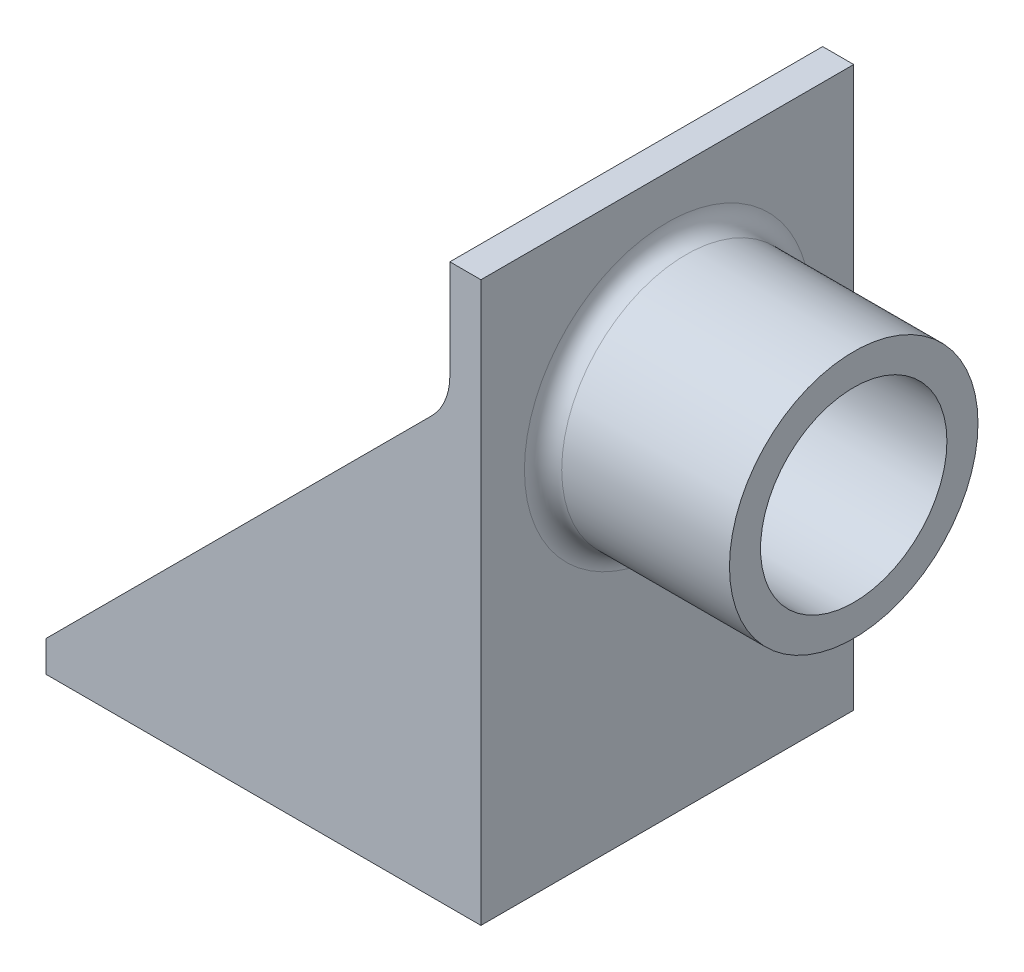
ISO-10303-21;
HEADER;
FILE_DESCRIPTION(('STEP AP214'),'2;1');
FILE_NAME('part.step','',(''),(''),'','','');
FILE_SCHEMA(('AUTOMOTIVE_DESIGN { 1 0 10303 214 1 1 1 1 }'));
ENDSEC;
DATA;
#1=APPLICATION_CONTEXT('core data for automotive mechanical design processes');
#2=APPLICATION_PROTOCOL_DEFINITION('international standard','automotive_design',2000,#1);
#3=PRODUCT_CONTEXT('',#1,'mechanical');
#4=PRODUCT('Part','Part','',(#3));
#5=PRODUCT_RELATED_PRODUCT_CATEGORY('part','',(#4));
#6=PRODUCT_DEFINITION_FORMATION('','',#4);
#7=PRODUCT_DEFINITION_CONTEXT('part definition',#1,'design');
#8=PRODUCT_DEFINITION('design','',#6,#7);
#9=PRODUCT_DEFINITION_SHAPE('','',#8);
#10=(LENGTH_UNIT() NAMED_UNIT(*) SI_UNIT(.MILLI.,.METRE.));
#11=(NAMED_UNIT(*) PLANE_ANGLE_UNIT() SI_UNIT($,.RADIAN.));
#12=(NAMED_UNIT(*) SI_UNIT($,.STERADIAN.) SOLID_ANGLE_UNIT());
#13=UNCERTAINTY_MEASURE_WITH_UNIT(LENGTH_MEASURE(1.E-05),#10,'distance_accuracy_value','');
#14=(GEOMETRIC_REPRESENTATION_CONTEXT(3) GLOBAL_UNCERTAINTY_ASSIGNED_CONTEXT((#13)) GLOBAL_UNIT_ASSIGNED_CONTEXT((#10,
#11,#12)) REPRESENTATION_CONTEXT('',''));
#15=CARTESIAN_POINT('',(0.,0.,0.));
#16=DIRECTION('',(0.,0.,1.));
#17=DIRECTION('',(1.,0.,0.));
#18=AXIS2_PLACEMENT_3D('',#15,#16,#17);
#19=CARTESIAN_POINT('',(70.,0.,30.));
#20=DIRECTION('',(-1.,0.,0.));
#21=DIRECTION('',(0.,0.,1.));
#22=AXIS2_PLACEMENT_3D('',#19,#20,#21);
#23=PLANE('',#22);
#24=CARTESIAN_POINT('',(70.,60.,0.));
#25=DIRECTION('',(-1.,0.,0.));
#26=DIRECTION('',(0.,0.,1.));
#27=AXIS2_PLACEMENT_3D('',#24,#25,#26);
#28=CIRCLE('',#27,23.);
#29=CARTESIAN_POINT('',(70.,60.,23.));
#30=VERTEX_POINT('',#29);
#31=EDGE_CURVE('E11',#30,#30,#28,.T.);
#32=ORIENTED_EDGE('',*,*,#31,.T.);
#33=EDGE_LOOP('',(#32));
#34=FACE_BOUND('',#33,.T.);
#35=DIRECTION('',(0.,1.,0.));
#36=VECTOR('',#35,1.);
#37=CARTESIAN_POINT('',(70.,0.,-30.));
#38=LINE('',#37,#36);
#39=CARTESIAN_POINT('',(70.,0.,-30.));
#40=VERTEX_POINT('',#39);
#41=CARTESIAN_POINT('',(70.,90.,-30.));
#42=VERTEX_POINT('',#41);
#43=EDGE_CURVE('E264',#40,#42,#38,.T.);
#44=ORIENTED_EDGE('',*,*,#43,.T.);
#45=DIRECTION('',(0.,0.,-1.));
#46=VECTOR('',#45,1.);
#47=CARTESIAN_POINT('',(70.,90.,30.));
#48=LINE('',#47,#46);
#49=CARTESIAN_POINT('',(70.,90.,30.));
#50=VERTEX_POINT('',#49);
#51=EDGE_CURVE('E275',#50,#42,#48,.T.);
#52=ORIENTED_EDGE('',*,*,#51,.F.);
#53=DIRECTION('',(0.,1.,0.));
#54=VECTOR('',#53,1.);
#55=CARTESIAN_POINT('',(70.,0.,30.));
#56=LINE('',#55,#54);
#57=CARTESIAN_POINT('',(70.,0.,30.));
#58=VERTEX_POINT('',#57);
#59=EDGE_CURVE('E253',#58,#50,#56,.T.);
#60=ORIENTED_EDGE('',*,*,#59,.F.);
#61=DIRECTION('',(0.,0.,-1.));
#62=VECTOR('',#61,1.);
#63=CARTESIAN_POINT('',(70.,0.,30.));
#64=LINE('',#63,#62);
#65=EDGE_CURVE('E278',#58,#40,#64,.T.);
#66=ORIENTED_EDGE('',*,*,#65,.T.);
#67=EDGE_LOOP('',(#44,#52,#60,#66));
#68=FACE_BOUND('',#67,.T.);
#69=ADVANCED_FACE('F34',(#34,#68),#23,.F.);
#70=CARTESIAN_POINT('',(65.,5.,30.));
#71=DIRECTION('',(0.,-1.,0.));
#72=DIRECTION('',(1.,0.,0.));
#73=AXIS2_PLACEMENT_3D('',#70,#71,#72);
#74=PLANE('',#73);
#75=DIRECTION('',(1.,0.,0.));
#76=VECTOR('',#75,1.);
#77=CARTESIAN_POINT('',(55.,5.,-25.));
#78=LINE('',#77,#76);
#79=CARTESIAN_POINT('',(0.,4.99999999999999,-25.));
#80=VERTEX_POINT('',#79);
#81=CARTESIAN_POINT('',(55.,5.,-25.));
#82=VERTEX_POINT('',#81);
#83=EDGE_CURVE('E128',#80,#82,#78,.T.);
#84=ORIENTED_EDGE('',*,*,#83,.F.);
#85=DIRECTION('',(0.,0.,-1.));
#86=VECTOR('',#85,1.);
#87=CARTESIAN_POINT('',(0.,4.99999999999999,30.));
#88=LINE('',#87,#86);
#89=CARTESIAN_POINT('',(0.,4.99999999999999,25.));
#90=VERTEX_POINT('',#89);
#91=EDGE_CURVE('E260',#90,#80,#88,.T.);
#92=ORIENTED_EDGE('',*,*,#91,.F.);
#93=DIRECTION('',(1.,0.,0.));
#94=VECTOR('',#93,1.);
#95=CARTESIAN_POINT('',(55.,5.,25.));
#96=LINE('',#95,#94);
#97=CARTESIAN_POINT('',(55.,5.,25.));
#98=VERTEX_POINT('',#97);
#99=EDGE_CURVE('E242',#90,#98,#96,.T.);
#100=ORIENTED_EDGE('',*,*,#99,.T.);
#101=DIRECTION('',(0.,0.,-1.));
#102=VECTOR('',#101,1.);
#103=CARTESIAN_POINT('',(55.,5.,-30.));
#104=LINE('',#103,#102);
#105=EDGE_CURVE('E145',#98,#82,#104,.T.);
#106=ORIENTED_EDGE('',*,*,#105,.T.);
#107=EDGE_LOOP('',(#84,#92,#100,#106));
#108=FACE_BOUND('',#107,.T.);
#109=ADVANCED_FACE('F182',(#108),#74,.F.);
#110=CARTESIAN_POINT('',(55.,15.,30.));
#111=DIRECTION('',(0.,0.,1.));
#112=DIRECTION('',(1.,0.,0.));
#113=AXIS2_PLACEMENT_3D('',#110,#111,#112);
#114=CYLINDRICAL_SURFACE('',#113,10.);
#115=CARTESIAN_POINT('',(55.,15.,-25.));
#116=DIRECTION('',(0.,0.,1.));
#117=DIRECTION('',(1.,0.,0.));
#118=AXIS2_PLACEMENT_3D('',#115,#116,#117);
#119=CIRCLE('',#118,10.);
#120=CARTESIAN_POINT('',(65.,15.,-25.));
#121=VERTEX_POINT('',#120);
#122=EDGE_CURVE('E122',#82,#121,#119,.T.);
#123=ORIENTED_EDGE('',*,*,#122,.F.);
#124=ORIENTED_EDGE('',*,*,#105,.F.);
#125=CARTESIAN_POINT('',(55.,15.,25.));
#126=DIRECTION('',(0.,0.,1.));
#127=DIRECTION('',(1.,0.,0.));
#128=AXIS2_PLACEMENT_3D('',#125,#126,#127);
#129=CIRCLE('',#128,10.);
#130=CARTESIAN_POINT('',(65.,15.,25.));
#131=VERTEX_POINT('',#130);
#132=EDGE_CURVE('E144',#98,#131,#129,.T.);
#133=ORIENTED_EDGE('',*,*,#132,.T.);
#134=DIRECTION('',(0.,0.,-1.));
#135=VECTOR('',#134,1.);
#136=CARTESIAN_POINT('',(65.,15.,30.));
#137=LINE('',#136,#135);
#138=EDGE_CURVE('E136',#121,#131,#137,.F.);
#139=ORIENTED_EDGE('',*,*,#138,.F.);
#140=EDGE_LOOP('',(#123,#124,#133,#139));
#141=FACE_BOUND('',#140,.T.);
#142=ADVANCED_FACE('F143',(#141),#114,.F.);
#143=CARTESIAN_POINT('',(65.,90.,30.));
#144=DIRECTION('',(1.,0.,0.));
#145=DIRECTION('',(0.,1.,0.));
#146=AXIS2_PLACEMENT_3D('',#143,#144,#145);
#147=PLANE('',#146);
#148=DIRECTION('',(0.,1.,0.));
#149=VECTOR('',#148,1.);
#150=CARTESIAN_POINT('',(65.,70.,25.));
#151=LINE('',#150,#149);
#152=CARTESIAN_POINT('',(65.,74.142135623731,25.));
#153=VERTEX_POINT('',#152);
#154=EDGE_CURVE('E238',#131,#153,#151,.T.);
#155=ORIENTED_EDGE('',*,*,#154,.T.);
#156=DIRECTION('',(0.,0.,1.));
#157=VECTOR('',#156,1.);
#158=CARTESIAN_POINT('',(65.,74.142135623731,30.));
#159=LINE('',#158,#157);
#160=CARTESIAN_POINT('',(65.,74.142135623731,30.));
#161=VERTEX_POINT('',#160);
#162=EDGE_CURVE('E147',#153,#161,#159,.T.);
#163=ORIENTED_EDGE('',*,*,#162,.T.);
#164=DIRECTION('',(0.,-1.,0.));
#165=VECTOR('',#164,1.);
#166=CARTESIAN_POINT('',(65.,90.,30.));
#167=LINE('',#166,#165);
#168=CARTESIAN_POINT('',(65.,90.,30.));
#169=VERTEX_POINT('',#168);
#170=EDGE_CURVE('E257',#169,#161,#167,.T.);
#171=ORIENTED_EDGE('',*,*,#170,.F.);
#172=DIRECTION('',(0.,0.,-1.));
#173=VECTOR('',#172,1.);
#174=CARTESIAN_POINT('',(65.,90.,30.));
#175=LINE('',#174,#173);
#176=CARTESIAN_POINT('',(65.,90.,-30.));
#177=VERTEX_POINT('',#176);
#178=EDGE_CURVE('E272',#169,#177,#175,.T.);
#179=ORIENTED_EDGE('',*,*,#178,.T.);
#180=DIRECTION('',(0.,-1.,0.));
#181=VECTOR('',#180,1.);
#182=CARTESIAN_POINT('',(65.,90.,-30.));
#183=LINE('',#182,#181);
#184=CARTESIAN_POINT('',(65.,74.142135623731,-30.));
#185=VERTEX_POINT('',#184);
#186=EDGE_CURVE('E251',#177,#185,#183,.T.);
#187=ORIENTED_EDGE('',*,*,#186,.T.);
#188=DIRECTION('',(0.,0.,-1.));
#189=VECTOR('',#188,1.);
#190=CARTESIAN_POINT('',(65.,74.142135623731,-25.));
#191=LINE('',#190,#189);
#192=CARTESIAN_POINT('',(65.,74.142135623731,-25.));
#193=VERTEX_POINT('',#192);
#194=EDGE_CURVE('E139',#185,#193,#191,.F.);
#195=ORIENTED_EDGE('',*,*,#194,.T.);
#196=DIRECTION('',(0.,1.,0.));
#197=VECTOR('',#196,1.);
#198=CARTESIAN_POINT('',(65.,70.,-25.));
#199=LINE('',#198,#197);
#200=EDGE_CURVE('E125',#121,#193,#199,.T.);
#201=ORIENTED_EDGE('',*,*,#200,.F.);
#202=ORIENTED_EDGE('',*,*,#138,.T.);
#203=EDGE_LOOP('',(#155,#163,#171,#179,#187,#195,#201,#202));
#204=FACE_BOUND('',#203,.T.);
#205=ADVANCED_FACE('F135',(#204),#147,.F.);
#206=CARTESIAN_POINT('',(0.,4.99999999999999,30.));
#207=DIRECTION('',(1.,0.,0.));
#208=DIRECTION('',(0.,1.,0.));
#209=AXIS2_PLACEMENT_3D('',#206,#207,#208);
#210=PLANE('',#209);
#211=DIRECTION('',(0.,-1.,0.));
#212=VECTOR('',#211,1.);
#213=CARTESIAN_POINT('',(0.,4.99999999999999,-30.));
#214=LINE('',#213,#212);
#215=CARTESIAN_POINT('',(0.,4.99999999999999,-30.));
#216=VERTEX_POINT('',#215);
#217=CARTESIAN_POINT('',(0.,0.,-30.));
#218=VERTEX_POINT('',#217);
#219=EDGE_CURVE('E226',#216,#218,#214,.T.);
#220=ORIENTED_EDGE('',*,*,#219,.T.);
#221=DIRECTION('',(0.,0.,-1.));
#222=VECTOR('',#221,1.);
#223=CARTESIAN_POINT('',(0.,0.,30.));
#224=LINE('',#223,#222);
#225=CARTESIAN_POINT('',(0.,0.,30.));
#226=VERTEX_POINT('',#225);
#227=EDGE_CURVE('E149',#226,#218,#224,.T.);
#228=ORIENTED_EDGE('',*,*,#227,.F.);
#229=DIRECTION('',(0.,-1.,0.));
#230=VECTOR('',#229,1.);
#231=CARTESIAN_POINT('',(0.,4.99999999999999,30.));
#232=LINE('',#231,#230);
#233=CARTESIAN_POINT('',(0.,4.99999999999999,30.));
#234=VERTEX_POINT('',#233);
#235=EDGE_CURVE('E247',#234,#226,#232,.T.);
#236=ORIENTED_EDGE('',*,*,#235,.F.);
#237=EDGE_CURVE('E269',#234,#90,#88,.T.);
#238=ORIENTED_EDGE('',*,*,#237,.T.);
#239=ORIENTED_EDGE('',*,*,#91,.T.);
#240=DIRECTION('',(0.,0.,-1.));
#241=VECTOR('',#240,1.);
#242=CARTESIAN_POINT('',(0.,4.99999999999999,-25.));
#243=LINE('',#242,#241);
#244=EDGE_CURVE('E235',#80,#216,#243,.T.);
#245=ORIENTED_EDGE('',*,*,#244,.T.);
#246=EDGE_LOOP('',(#220,#228,#236,#238,#239,#245));
#247=FACE_BOUND('',#246,.T.);
#248=ADVANCED_FACE('F197',(#247),#210,.F.);
#249=CARTESIAN_POINT('',(0.,0.,30.));
#250=DIRECTION('',(0.,1.,0.));
#251=DIRECTION('',(0.,0.,1.));
#252=AXIS2_PLACEMENT_3D('',#249,#250,#251);
#253=PLANE('',#252);
#254=DIRECTION('',(1.,0.,0.));
#255=VECTOR('',#254,1.);
#256=CARTESIAN_POINT('',(0.,0.,-30.));
#257=LINE('',#256,#255);
#258=EDGE_CURVE('E262',#218,#40,#257,.T.);
#259=ORIENTED_EDGE('',*,*,#258,.T.);
#260=ORIENTED_EDGE('',*,*,#65,.F.);
#261=DIRECTION('',(1.,0.,0.));
#262=VECTOR('',#261,1.);
#263=CARTESIAN_POINT('',(0.,0.,30.));
#264=LINE('',#263,#262);
#265=EDGE_CURVE('E250',#226,#58,#264,.T.);
#266=ORIENTED_EDGE('',*,*,#265,.F.);
#267=ORIENTED_EDGE('',*,*,#227,.T.);
#268=EDGE_LOOP('',(#259,#260,#266,#267));
#269=FACE_BOUND('',#268,.T.);
#270=ADVANCED_FACE('F194',(#269),#253,.F.);
#271=CARTESIAN_POINT('',(70.,90.,30.));
#272=DIRECTION('',(0.,-1.,0.));
#273=DIRECTION('',(1.,0.,0.));
#274=AXIS2_PLACEMENT_3D('',#271,#272,#273);
#275=PLANE('',#274);
#276=DIRECTION('',(-1.,0.,0.));
#277=VECTOR('',#276,1.);
#278=CARTESIAN_POINT('',(70.,90.,-30.));
#279=LINE('',#278,#277);
#280=EDGE_CURVE('E266',#42,#177,#279,.T.);
#281=ORIENTED_EDGE('',*,*,#280,.T.);
#282=ORIENTED_EDGE('',*,*,#178,.F.);
#283=DIRECTION('',(-1.,0.,0.));
#284=VECTOR('',#283,1.);
#285=CARTESIAN_POINT('',(70.,90.,30.));
#286=LINE('',#285,#284);
#287=EDGE_CURVE('E255',#50,#169,#286,.T.);
#288=ORIENTED_EDGE('',*,*,#287,.F.);
#289=ORIENTED_EDGE('',*,*,#51,.T.);
#290=EDGE_LOOP('',(#281,#282,#288,#289));
#291=FACE_BOUND('',#290,.T.);
#292=ADVANCED_FACE('F192',(#291),#275,.F.);
#293=CARTESIAN_POINT('',(0.,0.,30.));
#294=DIRECTION('',(0.,0.,1.));
#295=DIRECTION('',(1.,0.,0.));
#296=AXIS2_PLACEMENT_3D('',#293,#294,#295);
#297=PLANE('',#296);
#298=ORIENTED_EDGE('',*,*,#170,.T.);
#299=CARTESIAN_POINT('',(55.,74.142135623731,30.));
#300=DIRECTION('',(0.,0.,1.));
#301=DIRECTION('',(1.,0.,0.));
#302=AXIS2_PLACEMENT_3D('',#299,#300,#301);
#303=CIRCLE('',#302,10.);
#304=CARTESIAN_POINT('',(62.0710678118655,67.0710678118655,30.));
#305=VERTEX_POINT('',#304);
#306=EDGE_CURVE('E159',#161,#305,#303,.F.);
#307=ORIENTED_EDGE('',*,*,#306,.T.);
#308=DIRECTION('',(-0.707106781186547,-0.707106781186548,0.));
#309=VECTOR('',#308,1.);
#310=CARTESIAN_POINT('',(65.,70.,30.));
#311=LINE('',#310,#309);
#312=EDGE_CURVE('E237',#305,#234,#311,.T.);
#313=ORIENTED_EDGE('',*,*,#312,.T.);
#314=ORIENTED_EDGE('',*,*,#235,.T.);
#315=ORIENTED_EDGE('',*,*,#265,.T.);
#316=ORIENTED_EDGE('',*,*,#59,.T.);
#317=ORIENTED_EDGE('',*,*,#287,.T.);
#318=EDGE_LOOP('',(#298,#307,#313,#314,#315,#316,#317));
#319=FACE_BOUND('',#318,.T.);
#320=ADVANCED_FACE('F315',(#319),#297,.T.);
#321=CARTESIAN_POINT('',(0.,0.,-30.));
#322=DIRECTION('',(0.,0.,1.));
#323=DIRECTION('',(1.,0.,0.));
#324=AXIS2_PLACEMENT_3D('',#321,#322,#323);
#325=PLANE('',#324);
#326=DIRECTION('',(-0.707106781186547,-0.707106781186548,0.));
#327=VECTOR('',#326,1.);
#328=CARTESIAN_POINT('',(65.,70.,-30.));
#329=LINE('',#328,#327);
#330=CARTESIAN_POINT('',(62.0710678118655,67.0710678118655,-30.));
#331=VERTEX_POINT('',#330);
#332=EDGE_CURVE('E140',#331,#216,#329,.T.);
#333=ORIENTED_EDGE('',*,*,#332,.F.);
#334=CARTESIAN_POINT('',(55.,74.142135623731,-30.));
#335=DIRECTION('',(0.,0.,1.));
#336=DIRECTION('',(1.,0.,0.));
#337=AXIS2_PLACEMENT_3D('',#334,#335,#336);
#338=CIRCLE('',#337,10.);
#339=EDGE_CURVE('E57',#331,#185,#338,.T.);
#340=ORIENTED_EDGE('',*,*,#339,.T.);
#341=ORIENTED_EDGE('',*,*,#186,.F.);
#342=ORIENTED_EDGE('',*,*,#280,.F.);
#343=ORIENTED_EDGE('',*,*,#43,.F.);
#344=ORIENTED_EDGE('',*,*,#258,.F.);
#345=ORIENTED_EDGE('',*,*,#219,.F.);
#346=EDGE_LOOP('',(#333,#340,#341,#342,#343,#344,#345));
#347=FACE_BOUND('',#346,.T.);
#348=ADVANCED_FACE('F223',(#347),#325,.F.);
#349=CARTESIAN_POINT('',(65.,70.,25.));
#350=DIRECTION('',(-0.707106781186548,0.707106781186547,0.));
#351=DIRECTION('',(-0.707106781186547,-0.707106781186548,0.));
#352=AXIS2_PLACEMENT_3D('',#349,#350,#351);
#353=PLANE('',#352);
#354=ORIENTED_EDGE('',*,*,#312,.F.);
#355=DIRECTION('',(0.,0.,1.));
#356=VECTOR('',#355,1.);
#357=CARTESIAN_POINT('',(62.0710678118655,67.0710678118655,25.));
#358=LINE('',#357,#356);
#359=CARTESIAN_POINT('',(62.0710678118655,67.0710678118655,25.));
#360=VERTEX_POINT('',#359);
#361=EDGE_CURVE('E155',#305,#360,#358,.F.);
#362=ORIENTED_EDGE('',*,*,#361,.T.);
#363=DIRECTION('',(-0.707106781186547,-0.707106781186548,0.));
#364=VECTOR('',#363,1.);
#365=CARTESIAN_POINT('',(65.,70.,25.));
#366=LINE('',#365,#364);
#367=EDGE_CURVE('E240',#360,#90,#366,.T.);
#368=ORIENTED_EDGE('',*,*,#367,.T.);
#369=ORIENTED_EDGE('',*,*,#237,.F.);
#370=EDGE_LOOP('',(#354,#362,#368,#369));
#371=FACE_BOUND('',#370,.T.);
#372=ADVANCED_FACE('F310',(#371),#353,.T.);
#373=CARTESIAN_POINT('',(55.,15.,25.));
#374=DIRECTION('',(0.,0.,1.));
#375=DIRECTION('',(1.,0.,0.));
#376=AXIS2_PLACEMENT_3D('',#373,#374,#375);
#377=PLANE('',#376);
#378=ORIENTED_EDGE('',*,*,#154,.F.);
#379=ORIENTED_EDGE('',*,*,#132,.F.);
#380=ORIENTED_EDGE('',*,*,#99,.F.);
#381=ORIENTED_EDGE('',*,*,#367,.F.);
#382=CARTESIAN_POINT('',(55.,74.142135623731,25.));
#383=DIRECTION('',(0.,0.,1.));
#384=DIRECTION('',(1.,0.,0.));
#385=AXIS2_PLACEMENT_3D('',#382,#383,#384);
#386=CIRCLE('',#385,10.);
#387=EDGE_CURVE('E161',#360,#153,#386,.T.);
#388=ORIENTED_EDGE('',*,*,#387,.T.);
#389=EDGE_LOOP('',(#378,#379,#380,#381,#388));
#390=FACE_BOUND('',#389,.T.);
#391=ADVANCED_FACE('F307',(#390),#377,.F.);
#392=CARTESIAN_POINT('',(65.,70.,-25.));
#393=DIRECTION('',(0.707106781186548,-0.707106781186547,0.));
#394=DIRECTION('',(0.707106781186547,0.707106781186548,0.));
#395=AXIS2_PLACEMENT_3D('',#392,#393,#394);
#396=PLANE('',#395);
#397=DIRECTION('',(-0.707106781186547,-0.707106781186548,0.));
#398=VECTOR('',#397,1.);
#399=CARTESIAN_POINT('',(65.,70.,-25.));
#400=LINE('',#399,#398);
#401=CARTESIAN_POINT('',(62.0710678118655,67.0710678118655,-25.));
#402=VERTEX_POINT('',#401);
#403=EDGE_CURVE('E220',#402,#80,#400,.T.);
#404=ORIENTED_EDGE('',*,*,#403,.F.);
#405=DIRECTION('',(0.,0.,-1.));
#406=VECTOR('',#405,1.);
#407=CARTESIAN_POINT('',(62.0710678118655,67.0710678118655,-30.));
#408=LINE('',#407,#406);
#409=EDGE_CURVE('E157',#402,#331,#408,.T.);
#410=ORIENTED_EDGE('',*,*,#409,.T.);
#411=ORIENTED_EDGE('',*,*,#332,.T.);
#412=ORIENTED_EDGE('',*,*,#244,.F.);
#413=EDGE_LOOP('',(#404,#410,#411,#412));
#414=FACE_BOUND('',#413,.T.);
#415=ADVANCED_FACE('F217',(#414),#396,.F.);
#416=CARTESIAN_POINT('',(55.,15.,-25.));
#417=DIRECTION('',(0.,0.,-1.));
#418=DIRECTION('',(1.,0.,0.));
#419=AXIS2_PLACEMENT_3D('',#416,#417,#418);
#420=PLANE('',#419);
#421=ORIENTED_EDGE('',*,*,#200,.T.);
#422=CARTESIAN_POINT('',(55.,74.142135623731,-25.));
#423=DIRECTION('',(0.,0.,-1.));
#424=DIRECTION('',(-1.,0.,0.));
#425=AXIS2_PLACEMENT_3D('',#422,#423,#424);
#426=CIRCLE('',#425,10.);
#427=EDGE_CURVE('E49',#193,#402,#426,.T.);
#428=ORIENTED_EDGE('',*,*,#427,.T.);
#429=ORIENTED_EDGE('',*,*,#403,.T.);
#430=ORIENTED_EDGE('',*,*,#83,.T.);
#431=ORIENTED_EDGE('',*,*,#122,.T.);
#432=EDGE_LOOP('',(#421,#428,#429,#430,#431));
#433=FACE_BOUND('',#432,.T.);
#434=ADVANCED_FACE('F124',(#433),#420,.F.);
#435=CARTESIAN_POINT('',(55.,74.142135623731,30.));
#436=DIRECTION('',(0.,0.,1.));
#437=DIRECTION('',(1.,0.,0.));
#438=AXIS2_PLACEMENT_3D('',#435,#436,#437);
#439=CYLINDRICAL_SURFACE('',#438,10.);
#440=ORIENTED_EDGE('',*,*,#387,.F.);
#441=ORIENTED_EDGE('',*,*,#361,.F.);
#442=ORIENTED_EDGE('',*,*,#306,.F.);
#443=ORIENTED_EDGE('',*,*,#162,.F.);
#444=EDGE_LOOP('',(#440,#441,#442,#443));
#445=FACE_BOUND('',#444,.T.);
#446=ADVANCED_FACE('F204',(#445),#439,.F.);
#447=CARTESIAN_POINT('',(55.,74.142135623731,-25.));
#448=DIRECTION('',(0.,0.,1.));
#449=DIRECTION('',(1.,0.,0.));
#450=AXIS2_PLACEMENT_3D('',#447,#448,#449);
#451=CYLINDRICAL_SURFACE('',#450,10.);
#452=ORIENTED_EDGE('',*,*,#427,.F.);
#453=ORIENTED_EDGE('',*,*,#194,.F.);
#454=ORIENTED_EDGE('',*,*,#339,.F.);
#455=ORIENTED_EDGE('',*,*,#409,.F.);
#456=EDGE_LOOP('',(#452,#453,#454,#455));
#457=FACE_BOUND('',#456,.T.);
#458=ADVANCED_FACE('F206',(#457),#451,.F.);
#459=CARTESIAN_POINT('',(100.,60.,0.));
#460=DIRECTION('',(1.,0.,0.));
#461=DIRECTION('',(0.,0.,-1.));
#462=AXIS2_PLACEMENT_3D('',#459,#460,#461);
#463=PLANE('',#462);
#464=CARTESIAN_POINT('',(100.,60.,0.));
#465=DIRECTION('',(1.,0.,0.));
#466=DIRECTION('',(0.,0.,-1.));
#467=AXIS2_PLACEMENT_3D('',#464,#465,#466);
#468=CIRCLE('',#467,20.);
#469=CARTESIAN_POINT('',(100.,60.,-20.));
#470=VERTEX_POINT('',#469);
#471=EDGE_CURVE('E227',#470,#470,#468,.T.);
#472=ORIENTED_EDGE('',*,*,#471,.T.);
#473=EDGE_LOOP('',(#472));
#474=FACE_BOUND('',#473,.T.);
#475=CARTESIAN_POINT('',(100.,60.,0.));
#476=DIRECTION('',(1.,0.,0.));
#477=DIRECTION('',(0.,0.,-1.));
#478=AXIS2_PLACEMENT_3D('',#475,#476,#477);
#479=CIRCLE('',#478,15.);
#480=CARTESIAN_POINT('',(100.,60.,-15.));
#481=VERTEX_POINT('',#480);
#482=EDGE_CURVE('E230',#481,#481,#479,.T.);
#483=ORIENTED_EDGE('',*,*,#482,.F.);
#484=EDGE_LOOP('',(#483));
#485=FACE_BOUND('',#484,.T.);
#486=ADVANCED_FACE('F209',(#474,#485),#463,.T.);
#487=CARTESIAN_POINT('',(100.,60.,0.));
#488=DIRECTION('',(-1.,0.,0.));
#489=DIRECTION('',(0.,0.,1.));
#490=AXIS2_PLACEMENT_3D('',#487,#488,#489);
#491=CYLINDRICAL_SURFACE('',#490,20.);
#492=CARTESIAN_POINT('',(73.,60.,0.));
#493=DIRECTION('',(-1.,0.,0.));
#494=DIRECTION('',(0.,0.,1.));
#495=AXIS2_PLACEMENT_3D('',#492,#493,#494);
#496=CIRCLE('',#495,20.);
#497=CARTESIAN_POINT('',(73.,60.,20.));
#498=VERTEX_POINT('',#497);
#499=EDGE_CURVE('E42',#498,#498,#496,.F.);
#500=ORIENTED_EDGE('',*,*,#499,.T.);
#501=EDGE_LOOP('',(#500));
#502=FACE_BOUND('',#501,.T.);
#503=ORIENTED_EDGE('',*,*,#471,.F.);
#504=EDGE_LOOP('',(#503));
#505=FACE_BOUND('',#504,.T.);
#506=ADVANCED_FACE('F168',(#502,#505),#491,.T.);
#507=CARTESIAN_POINT('',(100.,60.,0.));
#508=DIRECTION('',(-1.,0.,0.));
#509=DIRECTION('',(0.,0.,1.));
#510=AXIS2_PLACEMENT_3D('',#507,#508,#509);
#511=CYLINDRICAL_SURFACE('',#510,15.);
#512=ORIENTED_EDGE('',*,*,#482,.T.);
#513=EDGE_LOOP('',(#512));
#514=FACE_BOUND('',#513,.T.);
#515=CARTESIAN_POINT('',(70.,60.,0.));
#516=DIRECTION('',(1.,0.,0.));
#517=DIRECTION('',(0.,0.,-1.));
#518=AXIS2_PLACEMENT_3D('',#515,#516,#517);
#519=CIRCLE('',#518,15.);
#520=CARTESIAN_POINT('',(70.,60.,-15.));
#521=VERTEX_POINT('',#520);
#522=EDGE_CURVE('E287',#521,#521,#519,.T.);
#523=ORIENTED_EDGE('',*,*,#522,.F.);
#524=EDGE_LOOP('',(#523));
#525=FACE_BOUND('',#524,.T.);
#526=ADVANCED_FACE('F177',(#514,#525),#511,.F.);
#527=ORIENTED_EDGE('',*,*,#522,.T.);
#528=EDGE_LOOP('',(#527));
#529=FACE_BOUND('',#528,.T.);
#530=ADVANCED_FACE('F172',(#529),#23,.F.);
#531=CARTESIAN_POINT('',(73.,60.,0.));
#532=DIRECTION('',(-1.,0.,0.));
#533=DIRECTION('',(0.,0.,1.));
#534=AXIS2_PLACEMENT_3D('',#531,#532,#533);
#535=TOROIDAL_SURFACE('',#534,23.,3.);
#536=ORIENTED_EDGE('',*,*,#31,.F.);
#537=EDGE_LOOP('',(#536));
#538=FACE_BOUND('',#537,.T.);
#539=ORIENTED_EDGE('',*,*,#499,.F.);
#540=EDGE_LOOP('',(#539));
#541=FACE_BOUND('',#540,.T.);
#542=ADVANCED_FACE('F36',(#538,#541),#535,.F.);
#543=CLOSED_SHELL('',(#69,#109,#142,#205,#248,#270,#292,#320,#348,#372,#391,#415,#434,#446,#458,
#486,#506,#526,#530,#542));
#544=MANIFOLD_SOLID_BREP('B2',#543);
#545=ADVANCED_BREP_SHAPE_REPRESENTATION('',(#18,#544),#14);
#546=SHAPE_DEFINITION_REPRESENTATION(#9,#545);
ENDSEC;
END-ISO-10303-21;
